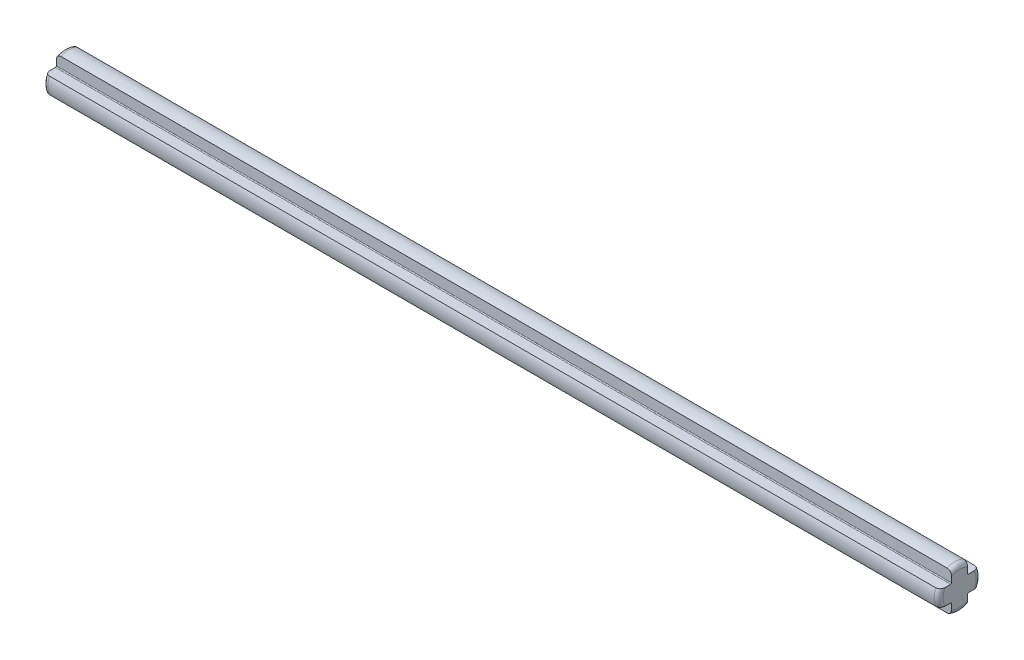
ISO-10303-21;
HEADER;
FILE_DESCRIPTION(('STEP AP214'),'2;1');
FILE_NAME('part.step','',(''),(''),'','','');
FILE_SCHEMA(('AUTOMOTIVE_DESIGN { 1 0 10303 214 1 1 1 1 }'));
ENDSEC;
DATA;
#1=APPLICATION_CONTEXT('core data for automotive mechanical design processes');
#2=APPLICATION_PROTOCOL_DEFINITION('international standard','automotive_design',2000,#1);
#3=PRODUCT_CONTEXT('',#1,'mechanical');
#4=PRODUCT('Part','Part','',(#3));
#5=PRODUCT_RELATED_PRODUCT_CATEGORY('part','',(#4));
#6=PRODUCT_DEFINITION_FORMATION('','',#4);
#7=PRODUCT_DEFINITION_CONTEXT('part definition',#1,'design');
#8=PRODUCT_DEFINITION('design','',#6,#7);
#9=PRODUCT_DEFINITION_SHAPE('','',#8);
#10=(LENGTH_UNIT() NAMED_UNIT(*) SI_UNIT(.MILLI.,.METRE.));
#11=(NAMED_UNIT(*) PLANE_ANGLE_UNIT() SI_UNIT($,.RADIAN.));
#12=(NAMED_UNIT(*) SI_UNIT($,.STERADIAN.) SOLID_ANGLE_UNIT());
#13=UNCERTAINTY_MEASURE_WITH_UNIT(LENGTH_MEASURE(1.E-05),#10,'distance_accuracy_value','');
#14=(GEOMETRIC_REPRESENTATION_CONTEXT(3) GLOBAL_UNCERTAINTY_ASSIGNED_CONTEXT((#13)) GLOBAL_UNIT_ASSIGNED_CONTEXT((#10,
#11,#12)) REPRESENTATION_CONTEXT('',''));
#15=CARTESIAN_POINT('',(0.,0.,0.));
#16=DIRECTION('',(0.,0.,1.));
#17=DIRECTION('',(1.,0.,0.));
#18=AXIS2_PLACEMENT_3D('',#15,#16,#17);
#19=CARTESIAN_POINT('',(50.,0.,0.));
#20=DIRECTION('',(-1.,0.,0.));
#21=DIRECTION('',(0.,0.,1.));
#22=AXIS2_PLACEMENT_3D('',#19,#20,#21);
#23=CYLINDRICAL_SURFACE('',#22,2.35);
#24=DIRECTION('',(-1.,0.,0.));
#25=VECTOR('',#24,1.);
#26=CARTESIAN_POINT('',(50.,0.9,2.17082933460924));
#27=LINE('',#26,#25);
#28=CARTESIAN_POINT('',(49.5,0.9,2.17082933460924));
#29=VERTEX_POINT('',#28);
#30=CARTESIAN_POINT('',(-49.5,0.9,2.17082933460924));
#31=VERTEX_POINT('',#30);
#32=EDGE_CURVE('E250',#29,#31,#27,.T.);
#33=ORIENTED_EDGE('',*,*,#32,.T.);
#34=CARTESIAN_POINT('',(-49.5,0.,0.));
#35=DIRECTION('',(1.,0.,0.));
#36=DIRECTION('',(0.,0.,-1.));
#37=AXIS2_PLACEMENT_3D('',#34,#35,#36);
#38=CIRCLE('',#37,2.35);
#39=CARTESIAN_POINT('',(-49.5,-0.900000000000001,2.17082933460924));
#40=VERTEX_POINT('',#39);
#41=EDGE_CURVE('E515',#31,#40,#38,.T.);
#42=ORIENTED_EDGE('',*,*,#41,.T.);
#43=DIRECTION('',(-1.,0.,0.));
#44=VECTOR('',#43,1.);
#45=CARTESIAN_POINT('',(50.,-0.900000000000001,2.17082933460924));
#46=LINE('',#45,#44);
#47=CARTESIAN_POINT('',(49.5,-0.900000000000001,2.17082933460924));
#48=VERTEX_POINT('',#47);
#49=EDGE_CURVE('E221',#48,#40,#46,.T.);
#50=ORIENTED_EDGE('',*,*,#49,.F.);
#51=CARTESIAN_POINT('',(49.5,0.,0.));
#52=DIRECTION('',(1.,0.,0.));
#53=DIRECTION('',(0.,0.,-1.));
#54=AXIS2_PLACEMENT_3D('',#51,#52,#53);
#55=CIRCLE('',#54,2.35);
#56=EDGE_CURVE('E370',#48,#29,#55,.F.);
#57=ORIENTED_EDGE('',*,*,#56,.T.);
#58=EDGE_LOOP('',(#33,#42,#50,#57));
#59=FACE_BOUND('',#58,.T.);
#60=ADVANCED_FACE('F37',(#59),#23,.T.);
#61=CARTESIAN_POINT('',(50.,-0.900000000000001,2.17082933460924));
#62=DIRECTION('',(0.,1.,0.));
#63=DIRECTION('',(0.,0.,1.));
#64=AXIS2_PLACEMENT_3D('',#61,#62,#63);
#65=PLANE('',#64);
#66=ORIENTED_EDGE('',*,*,#49,.T.);
#67=CARTESIAN_POINT('',(-49.5,-0.900000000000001,2.17082933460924));
#68=CARTESIAN_POINT('',(-49.5264833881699,-0.900000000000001,2.17085986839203));
#69=CARTESIAN_POINT('',(-49.5529498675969,-0.900000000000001,2.16855372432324));
#70=CARTESIAN_POINT('',(-49.6050453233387,-0.900000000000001,2.15950506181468));
#71=CARTESIAN_POINT('',(-49.6306762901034,-0.900000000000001,2.15277404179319));
#72=CARTESIAN_POINT('',(-49.6804387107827,-0.900000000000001,2.1351114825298));
#73=CARTESIAN_POINT('',(-49.7045703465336,-0.900000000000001,2.12418045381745));
#74=CARTESIAN_POINT('',(-49.7507251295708,-0.900000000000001,2.09852306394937));
#75=CARTESIAN_POINT('',(-49.7727475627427,-0.900000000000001,2.0837954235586));
#76=CARTESIAN_POINT('',(-49.8147234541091,-0.900000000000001,2.05060839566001));
#77=CARTESIAN_POINT('',(-49.8346070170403,-0.900000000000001,2.03206082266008));
#78=CARTESIAN_POINT('',(-49.8712243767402,-0.900000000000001,1.99209288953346));
#79=CARTESIAN_POINT('',(-49.8879579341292,-0.900000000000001,1.97067231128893));
#80=CARTESIAN_POINT('',(-49.9190973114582,-0.900000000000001,1.92396602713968));
#81=CARTESIAN_POINT('',(-49.9332527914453,-0.900000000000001,1.89851375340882));
#82=CARTESIAN_POINT('',(-49.9575247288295,-0.900000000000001,1.84573102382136));
#83=CARTESIAN_POINT('',(-49.9676367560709,-0.900000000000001,1.81839854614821));
#84=CARTESIAN_POINT('',(-49.9838866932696,-0.900000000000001,1.76219756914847));
#85=CARTESIAN_POINT('',(-49.9899702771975,-0.900000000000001,1.73331353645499));
#86=CARTESIAN_POINT('',(-49.9980270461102,-0.900000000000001,1.67505065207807));
#87=CARTESIAN_POINT('',(-50.0000109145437,-0.900000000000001,1.64567328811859));
#88=CARTESIAN_POINT('',(-50.,-0.900000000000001,1.61632298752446));
#89=B_SPLINE_CURVE_WITH_KNOTS('',3,(#67,#68,#69,#70,#71,#72,#73,#74,#75,#76,#77,#78,#79,#80,#81,
#82,#83,#84,#85,#86,#87,#88),.UNSPECIFIED.,.F.,.F.,(4,2,2,2,2,2,2,2,2,2,4),(0.,
0.0793238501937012,0.158442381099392,0.237551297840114,0.316686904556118,0.397909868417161,
0.479139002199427,0.56614777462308,0.653251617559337,0.74150740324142,0.829532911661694),.UNSPECIFIED.);
#90=CARTESIAN_POINT('',(-50.,-0.900000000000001,1.61632298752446));
#91=VERTEX_POINT('',#90);
#92=EDGE_CURVE('E390',#40,#91,#89,.T.);
#93=ORIENTED_EDGE('',*,*,#92,.T.);
#94=DIRECTION('',(0.,0.,-1.));
#95=VECTOR('',#94,1.);
#96=CARTESIAN_POINT('',(-50.,-0.900000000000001,2.17082933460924));
#97=LINE('',#96,#95);
#98=CARTESIAN_POINT('',(-50.,-0.900000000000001,0.999999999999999));
#99=VERTEX_POINT('',#98);
#100=EDGE_CURVE('E218',#91,#99,#97,.T.);
#101=ORIENTED_EDGE('',*,*,#100,.T.);
#102=DIRECTION('',(-1.,0.,0.));
#103=VECTOR('',#102,1.);
#104=CARTESIAN_POINT('',(50.,-0.900000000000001,0.999999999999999));
#105=LINE('',#104,#103);
#106=CARTESIAN_POINT('',(50.,-0.900000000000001,0.999999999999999));
#107=VERTEX_POINT('',#106);
#108=EDGE_CURVE('E214',#107,#99,#105,.T.);
#109=ORIENTED_EDGE('',*,*,#108,.F.);
#110=DIRECTION('',(0.,0.,-1.));
#111=VECTOR('',#110,1.);
#112=CARTESIAN_POINT('',(50.,-0.900000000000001,2.17082933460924));
#113=LINE('',#112,#111);
#114=CARTESIAN_POINT('',(50.,-0.900000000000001,1.61632298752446));
#115=VERTEX_POINT('',#114);
#116=EDGE_CURVE('E201',#115,#107,#113,.T.);
#117=ORIENTED_EDGE('',*,*,#116,.F.);
#118=CARTESIAN_POINT('',(50.,-0.900000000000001,1.61632298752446));
#119=CARTESIAN_POINT('',(50.0000222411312,-0.900000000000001,1.65066661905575));
#120=CARTESIAN_POINT('',(49.9972983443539,-0.900000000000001,1.68506058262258));
#121=CARTESIAN_POINT('',(49.9862156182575,-0.900000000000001,1.75308687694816));
#122=CARTESIAN_POINT('',(49.9778303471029,-0.900000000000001,1.78671486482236));
#123=CARTESIAN_POINT('',(49.9552419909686,-0.900000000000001,1.85211366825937));
#124=CARTESIAN_POINT('',(49.9410195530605,-0.900000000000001,1.88387790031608));
#125=CARTESIAN_POINT('',(49.9069131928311,-0.900000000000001,1.94414749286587));
#126=CARTESIAN_POINT('',(49.8870416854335,-0.900000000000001,1.97265980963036));
#127=CARTESIAN_POINT('',(49.844222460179,-0.900000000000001,2.02268935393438));
#128=CARTESIAN_POINT('',(49.8217526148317,-0.900000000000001,2.04461521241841));
#129=CARTESIAN_POINT('',(49.7730890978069,-0.900000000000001,2.08389547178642));
#130=CARTESIAN_POINT('',(49.7468952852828,-0.900000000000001,2.10124969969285));
#131=CARTESIAN_POINT('',(49.6943438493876,-0.900000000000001,2.12912089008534));
#132=CARTESIAN_POINT('',(49.6682509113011,-0.900000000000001,2.14013932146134));
#133=CARTESIAN_POINT('',(49.6145341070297,-0.900000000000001,2.15730052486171));
#134=CARTESIAN_POINT('',(49.586913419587,-0.900000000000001,2.1634530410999));
#135=CARTESIAN_POINT('',(49.5492135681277,-0.900000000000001,2.16830749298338));
#136=CARTESIAN_POINT('',(49.5393866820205,-0.900000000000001,2.1692533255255));
#137=CARTESIAN_POINT('',(49.5197081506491,-0.900000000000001,2.17051341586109));
#138=CARTESIAN_POINT('',(49.5098565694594,-0.900000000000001,2.17082867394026));
#139=CARTESIAN_POINT('',(49.5,-0.900000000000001,2.17082933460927));
#140=B_SPLINE_CURVE_WITH_KNOTS('',3,(#118,#119,#120,#121,#122,#123,#124,#125,#126,#127,#128,
#129,#130,#131,#132,#133,#134,#135,#136,#137,#138,#139),.UNSPECIFIED.,.F.,.F.,(4,2,2,2,2,2,2,2,
2,2,4),(0.,0.10300027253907,0.206484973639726,0.310315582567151,0.413919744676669,
0.507586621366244,0.60125704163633,0.685799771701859,0.770172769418,0.799774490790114,
0.829329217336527),.UNSPECIFIED.);
#141=EDGE_CURVE('E520',#115,#48,#140,.T.);
#142=ORIENTED_EDGE('',*,*,#141,.T.);
#143=EDGE_LOOP('',(#66,#93,#101,#109,#117,#142));
#144=FACE_BOUND('',#143,.T.);
#145=ADVANCED_FACE('F216',(#144),#65,.F.);
#146=CARTESIAN_POINT('',(50.,-1.,0.999999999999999));
#147=DIRECTION('',(-1.,0.,0.));
#148=DIRECTION('',(0.,0.,1.));
#149=AXIS2_PLACEMENT_3D('',#146,#147,#148);
#150=CYLINDRICAL_SURFACE('',#149,0.0999999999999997);
#151=CARTESIAN_POINT('',(-50.,-1.,0.999999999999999));
#152=DIRECTION('',(-1.,0.,0.));
#153=DIRECTION('',(0.,0.,1.));
#154=AXIS2_PLACEMENT_3D('',#151,#152,#153);
#155=CIRCLE('',#154,0.0999999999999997);
#156=CARTESIAN_POINT('',(-50.,-1.,0.899999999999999));
#157=VERTEX_POINT('',#156);
#158=EDGE_CURVE('E252',#99,#157,#155,.T.);
#159=ORIENTED_EDGE('',*,*,#158,.T.);
#160=DIRECTION('',(-1.,0.,0.));
#161=VECTOR('',#160,1.);
#162=CARTESIAN_POINT('',(50.,-1.,0.899999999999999));
#163=LINE('',#162,#161);
#164=CARTESIAN_POINT('',(50.,-1.,0.899999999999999));
#165=VERTEX_POINT('',#164);
#166=EDGE_CURVE('E222',#165,#157,#163,.T.);
#167=ORIENTED_EDGE('',*,*,#166,.F.);
#168=CARTESIAN_POINT('',(50.,-1.,0.999999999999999));
#169=DIRECTION('',(-1.,0.,0.));
#170=DIRECTION('',(0.,0.,1.));
#171=AXIS2_PLACEMENT_3D('',#168,#169,#170);
#172=CIRCLE('',#171,0.0999999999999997);
#173=EDGE_CURVE('E207',#107,#165,#172,.T.);
#174=ORIENTED_EDGE('',*,*,#173,.F.);
#175=ORIENTED_EDGE('',*,*,#108,.T.);
#176=EDGE_LOOP('',(#159,#167,#174,#175));
#177=FACE_BOUND('',#176,.T.);
#178=ADVANCED_FACE('F224',(#177),#150,.F.);
#179=CARTESIAN_POINT('',(50.,-2.17082933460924,0.899999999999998));
#180=DIRECTION('',(0.,0.,-1.));
#181=DIRECTION('',(0.,1.,0.));
#182=AXIS2_PLACEMENT_3D('',#179,#180,#181);
#183=PLANE('',#182);
#184=DIRECTION('',(0.,-1.,0.));
#185=VECTOR('',#184,1.);
#186=CARTESIAN_POINT('',(-50.,-2.17082933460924,0.899999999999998));
#187=LINE('',#186,#185);
#188=CARTESIAN_POINT('',(-50.,-1.61632298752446,0.899999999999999));
#189=VERTEX_POINT('',#188);
#190=EDGE_CURVE('E254',#157,#189,#187,.T.);
#191=ORIENTED_EDGE('',*,*,#190,.T.);
#192=CARTESIAN_POINT('',(-50.,-1.61632298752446,0.899999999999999));
#193=CARTESIAN_POINT('',(-50.0000222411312,-1.65066661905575,0.899999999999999));
#194=CARTESIAN_POINT('',(-49.9972983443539,-1.68506058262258,0.899999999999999));
#195=CARTESIAN_POINT('',(-49.9862156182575,-1.75308687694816,0.899999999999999));
#196=CARTESIAN_POINT('',(-49.9778303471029,-1.78671486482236,0.899999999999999));
#197=CARTESIAN_POINT('',(-49.9552419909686,-1.85211366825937,0.899999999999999));
#198=CARTESIAN_POINT('',(-49.9410195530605,-1.88387790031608,0.899999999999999));
#199=CARTESIAN_POINT('',(-49.9069131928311,-1.94414749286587,0.899999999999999));
#200=CARTESIAN_POINT('',(-49.8870416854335,-1.97265980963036,0.899999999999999));
#201=CARTESIAN_POINT('',(-49.844222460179,-2.02268935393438,0.899999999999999));
#202=CARTESIAN_POINT('',(-49.8217526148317,-2.04461521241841,0.899999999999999));
#203=CARTESIAN_POINT('',(-49.7730890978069,-2.08389547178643,0.899999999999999));
#204=CARTESIAN_POINT('',(-49.7468952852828,-2.10124969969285,0.899999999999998));
#205=CARTESIAN_POINT('',(-49.6943438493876,-2.12912089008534,0.899999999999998));
#206=CARTESIAN_POINT('',(-49.6682509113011,-2.14013932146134,0.899999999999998));
#207=CARTESIAN_POINT('',(-49.6145341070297,-2.15730052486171,0.899999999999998));
#208=CARTESIAN_POINT('',(-49.586913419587,-2.1634530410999,0.899999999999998));
#209=CARTESIAN_POINT('',(-49.5492135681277,-2.16830749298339,0.899999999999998));
#210=CARTESIAN_POINT('',(-49.5393866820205,-2.1692533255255,0.899999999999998));
#211=CARTESIAN_POINT('',(-49.5197081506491,-2.17051341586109,0.899999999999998));
#212=CARTESIAN_POINT('',(-49.5098565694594,-2.17082867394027,0.899999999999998));
#213=CARTESIAN_POINT('',(-49.5,-2.17082933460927,0.899999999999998));
#214=B_SPLINE_CURVE_WITH_KNOTS('',3,(#192,#193,#194,#195,#196,#197,#198,#199,#200,#201,#202,
#203,#204,#205,#206,#207,#208,#209,#210,#211,#212,#213),.UNSPECIFIED.,.F.,.F.,(4,2,2,2,2,2,2,2,
2,2,4),(0.,0.103000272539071,0.206484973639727,0.310315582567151,0.413919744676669,
0.507586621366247,0.601257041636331,0.68579977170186,0.770172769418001,0.799774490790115,
0.829329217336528),.UNSPECIFIED.);
#215=CARTESIAN_POINT('',(-49.5,-2.17082933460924,0.899999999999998));
#216=VERTEX_POINT('',#215);
#217=EDGE_CURVE('E365',#189,#216,#214,.T.);
#218=ORIENTED_EDGE('',*,*,#217,.T.);
#219=DIRECTION('',(-1.,0.,0.));
#220=VECTOR('',#219,1.);
#221=CARTESIAN_POINT('',(50.,-2.17082933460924,0.899999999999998));
#222=LINE('',#221,#220);
#223=CARTESIAN_POINT('',(49.5,-2.17082933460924,0.899999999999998));
#224=VERTEX_POINT('',#223);
#225=EDGE_CURVE('E312',#224,#216,#222,.T.);
#226=ORIENTED_EDGE('',*,*,#225,.F.);
#227=CARTESIAN_POINT('',(49.5,-2.17082933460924,0.899999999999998));
#228=CARTESIAN_POINT('',(49.5264833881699,-2.17085986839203,0.899999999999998));
#229=CARTESIAN_POINT('',(49.5529498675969,-2.16855372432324,0.899999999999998));
#230=CARTESIAN_POINT('',(49.6050453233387,-2.15950506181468,0.899999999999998));
#231=CARTESIAN_POINT('',(49.6306762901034,-2.15277404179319,0.899999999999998));
#232=CARTESIAN_POINT('',(49.6804387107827,-2.1351114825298,0.899999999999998));
#233=CARTESIAN_POINT('',(49.7045703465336,-2.12418045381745,0.899999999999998));
#234=CARTESIAN_POINT('',(49.7507251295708,-2.09852306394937,0.899999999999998));
#235=CARTESIAN_POINT('',(49.7727475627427,-2.0837954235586,0.899999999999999));
#236=CARTESIAN_POINT('',(49.8147234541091,-2.05060839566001,0.899999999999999));
#237=CARTESIAN_POINT('',(49.8346070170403,-2.03206082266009,0.899999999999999));
#238=CARTESIAN_POINT('',(49.8712243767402,-1.99209288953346,0.899999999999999));
#239=CARTESIAN_POINT('',(49.8879579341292,-1.97067231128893,0.899999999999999));
#240=CARTESIAN_POINT('',(49.9190973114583,-1.92396602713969,0.899999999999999));
#241=CARTESIAN_POINT('',(49.9332527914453,-1.89851375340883,0.899999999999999));
#242=CARTESIAN_POINT('',(49.9575247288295,-1.84573102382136,0.899999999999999));
#243=CARTESIAN_POINT('',(49.9676367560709,-1.81839854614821,0.899999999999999));
#244=CARTESIAN_POINT('',(49.9838866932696,-1.76219756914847,0.899999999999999));
#245=CARTESIAN_POINT('',(49.9899702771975,-1.733313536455,0.899999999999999));
#246=CARTESIAN_POINT('',(49.9980270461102,-1.67505065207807,0.899999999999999));
#247=CARTESIAN_POINT('',(50.0000109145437,-1.64567328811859,0.899999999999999));
#248=CARTESIAN_POINT('',(50.,-1.61632298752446,0.899999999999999));
#249=B_SPLINE_CURVE_WITH_KNOTS('',3,(#227,#228,#229,#230,#231,#232,#233,#234,#235,#236,#237,
#238,#239,#240,#241,#242,#243,#244,#245,#246,#247,#248),.UNSPECIFIED.,.F.,.F.,(4,2,2,2,2,2,2,2,
2,2,4),(0.,0.0793238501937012,0.158442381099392,0.237551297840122,0.316686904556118,
0.397909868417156,0.479139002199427,0.566147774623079,0.653251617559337,0.741507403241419,
0.829532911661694),.UNSPECIFIED.);
#250=CARTESIAN_POINT('',(50.,-1.61632298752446,0.899999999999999));
#251=VERTEX_POINT('',#250);
#252=EDGE_CURVE('E359',#224,#251,#249,.T.);
#253=ORIENTED_EDGE('',*,*,#252,.T.);
#254=DIRECTION('',(0.,-1.,0.));
#255=VECTOR('',#254,1.);
#256=CARTESIAN_POINT('',(50.,-2.17082933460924,0.899999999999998));
#257=LINE('',#256,#255);
#258=EDGE_CURVE('E227',#165,#251,#257,.T.);
#259=ORIENTED_EDGE('',*,*,#258,.F.);
#260=ORIENTED_EDGE('',*,*,#166,.T.);
#261=EDGE_LOOP('',(#191,#218,#226,#253,#259,#260));
#262=FACE_BOUND('',#261,.T.);
#263=ADVANCED_FACE('F350',(#262),#183,.F.);
#264=CARTESIAN_POINT('',(50.,0.,0.));
#265=DIRECTION('',(-1.,0.,0.));
#266=DIRECTION('',(0.,0.,1.));
#267=AXIS2_PLACEMENT_3D('',#264,#265,#266);
#268=CYLINDRICAL_SURFACE('',#267,2.35);
#269=ORIENTED_EDGE('',*,*,#225,.T.);
#270=CARTESIAN_POINT('',(-49.5,0.,0.));
#271=DIRECTION('',(1.,0.,0.));
#272=DIRECTION('',(0.,0.,-1.));
#273=AXIS2_PLACEMENT_3D('',#270,#271,#272);
#274=CIRCLE('',#273,2.35);
#275=CARTESIAN_POINT('',(-49.5,-2.17082933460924,-0.9));
#276=VERTEX_POINT('',#275);
#277=EDGE_CURVE('E319',#216,#276,#274,.T.);
#278=ORIENTED_EDGE('',*,*,#277,.T.);
#279=DIRECTION('',(-1.,0.,0.));
#280=VECTOR('',#279,1.);
#281=CARTESIAN_POINT('',(50.,-2.17082933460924,-0.9));
#282=LINE('',#281,#280);
#283=CARTESIAN_POINT('',(49.5,-2.17082933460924,-0.9));
#284=VERTEX_POINT('',#283);
#285=EDGE_CURVE('E309',#284,#276,#282,.T.);
#286=ORIENTED_EDGE('',*,*,#285,.F.);
#287=CARTESIAN_POINT('',(49.5,0.,0.));
#288=DIRECTION('',(1.,0.,0.));
#289=DIRECTION('',(0.,0.,-1.));
#290=AXIS2_PLACEMENT_3D('',#287,#288,#289);
#291=CIRCLE('',#290,2.35);
#292=EDGE_CURVE('E317',#284,#224,#291,.F.);
#293=ORIENTED_EDGE('',*,*,#292,.T.);
#294=EDGE_LOOP('',(#269,#278,#286,#293));
#295=FACE_BOUND('',#294,.T.);
#296=ADVANCED_FACE('F344',(#295),#268,.T.);
#297=CARTESIAN_POINT('',(50.,-2.17082933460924,-0.9));
#298=DIRECTION('',(0.,0.,1.));
#299=DIRECTION('',(0.,-1.,0.));
#300=AXIS2_PLACEMENT_3D('',#297,#298,#299);
#301=PLANE('',#300);
#302=ORIENTED_EDGE('',*,*,#285,.T.);
#303=CARTESIAN_POINT('',(-49.5,-2.17082933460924,-0.9));
#304=CARTESIAN_POINT('',(-49.5264833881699,-2.17085986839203,-0.9));
#305=CARTESIAN_POINT('',(-49.5529498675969,-2.16855372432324,-0.9));
#306=CARTESIAN_POINT('',(-49.6050453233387,-2.15950506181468,-0.9));
#307=CARTESIAN_POINT('',(-49.6306762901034,-2.15277404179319,-0.9));
#308=CARTESIAN_POINT('',(-49.6804387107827,-2.1351114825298,-0.9));
#309=CARTESIAN_POINT('',(-49.7045703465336,-2.12418045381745,-0.9));
#310=CARTESIAN_POINT('',(-49.7507251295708,-2.09852306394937,-0.9));
#311=CARTESIAN_POINT('',(-49.7727475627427,-2.0837954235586,-0.9));
#312=CARTESIAN_POINT('',(-49.8147234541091,-2.05060839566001,-0.9));
#313=CARTESIAN_POINT('',(-49.8346070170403,-2.03206082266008,-0.9));
#314=CARTESIAN_POINT('',(-49.8712243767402,-1.99209288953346,-0.9));
#315=CARTESIAN_POINT('',(-49.8879579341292,-1.97067231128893,-0.9));
#316=CARTESIAN_POINT('',(-49.9190973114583,-1.92396602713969,-0.9));
#317=CARTESIAN_POINT('',(-49.9332527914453,-1.89851375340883,-0.9));
#318=CARTESIAN_POINT('',(-49.9575247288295,-1.84573102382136,-0.9));
#319=CARTESIAN_POINT('',(-49.9676367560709,-1.81839854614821,-0.9));
#320=CARTESIAN_POINT('',(-49.9838866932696,-1.76219756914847,-0.9));
#321=CARTESIAN_POINT('',(-49.9899702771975,-1.73331353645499,-0.9));
#322=CARTESIAN_POINT('',(-49.9980270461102,-1.67505065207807,-0.9));
#323=CARTESIAN_POINT('',(-50.0000109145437,-1.64567328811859,-0.9));
#324=CARTESIAN_POINT('',(-50.,-1.61632298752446,-0.9));
#325=B_SPLINE_CURVE_WITH_KNOTS('',3,(#303,#304,#305,#306,#307,#308,#309,#310,#311,#312,#313,
#314,#315,#316,#317,#318,#319,#320,#321,#322,#323,#324),.UNSPECIFIED.,.F.,.F.,(4,2,2,2,2,2,2,2,
2,2,4),(0.,0.0793238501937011,0.158442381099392,0.237551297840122,0.316686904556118,
0.397909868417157,0.479139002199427,0.566147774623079,0.653251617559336,0.74150740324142,
0.829532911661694),.UNSPECIFIED.);
#326=CARTESIAN_POINT('',(-50.,-1.61632298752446,-0.9));
#327=VERTEX_POINT('',#326);
#328=EDGE_CURVE('E329',#276,#327,#325,.T.);
#329=ORIENTED_EDGE('',*,*,#328,.T.);
#330=DIRECTION('',(0.,1.,0.));
#331=VECTOR('',#330,1.);
#332=CARTESIAN_POINT('',(-50.,-2.17082933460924,-0.9));
#333=LINE('',#332,#331);
#334=CARTESIAN_POINT('',(-50.,-1.,-0.9));
#335=VERTEX_POINT('',#334);
#336=EDGE_CURVE('E257',#327,#335,#333,.T.);
#337=ORIENTED_EDGE('',*,*,#336,.T.);
#338=DIRECTION('',(-1.,0.,0.));
#339=VECTOR('',#338,1.);
#340=CARTESIAN_POINT('',(50.,-1.,-0.9));
#341=LINE('',#340,#339);
#342=CARTESIAN_POINT('',(50.,-1.,-0.9));
#343=VERTEX_POINT('',#342);
#344=EDGE_CURVE('E306',#343,#335,#341,.T.);
#345=ORIENTED_EDGE('',*,*,#344,.F.);
#346=DIRECTION('',(0.,1.,0.));
#347=VECTOR('',#346,1.);
#348=CARTESIAN_POINT('',(50.,-2.17082933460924,-0.9));
#349=LINE('',#348,#347);
#350=CARTESIAN_POINT('',(50.,-1.61632298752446,-0.9));
#351=VERTEX_POINT('',#350);
#352=EDGE_CURVE('E229',#351,#343,#349,.T.);
#353=ORIENTED_EDGE('',*,*,#352,.F.);
#354=CARTESIAN_POINT('',(50.,-1.61632298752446,-0.9));
#355=CARTESIAN_POINT('',(50.0000222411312,-1.65066661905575,-0.9));
#356=CARTESIAN_POINT('',(49.9972983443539,-1.68506058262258,-0.9));
#357=CARTESIAN_POINT('',(49.9862156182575,-1.75308687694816,-0.9));
#358=CARTESIAN_POINT('',(49.9778303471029,-1.78671486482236,-0.9));
#359=CARTESIAN_POINT('',(49.9552419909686,-1.85211366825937,-0.9));
#360=CARTESIAN_POINT('',(49.9410195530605,-1.88387790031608,-0.9));
#361=CARTESIAN_POINT('',(49.9069131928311,-1.94414749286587,-0.9));
#362=CARTESIAN_POINT('',(49.8870416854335,-1.97265980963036,-0.9));
#363=CARTESIAN_POINT('',(49.844222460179,-2.02268935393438,-0.9));
#364=CARTESIAN_POINT('',(49.8217526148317,-2.04461521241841,-0.9));
#365=CARTESIAN_POINT('',(49.7730890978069,-2.08389547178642,-0.9));
#366=CARTESIAN_POINT('',(49.7468952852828,-2.10124969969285,-0.9));
#367=CARTESIAN_POINT('',(49.6943438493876,-2.12912089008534,-0.9));
#368=CARTESIAN_POINT('',(49.6682509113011,-2.14013932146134,-0.9));
#369=CARTESIAN_POINT('',(49.6145341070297,-2.15730052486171,-0.9));
#370=CARTESIAN_POINT('',(49.586913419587,-2.1634530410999,-0.9));
#371=CARTESIAN_POINT('',(49.5492135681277,-2.16830749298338,-0.9));
#372=CARTESIAN_POINT('',(49.5393866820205,-2.1692533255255,-0.9));
#373=CARTESIAN_POINT('',(49.5197081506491,-2.17051341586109,-0.9));
#374=CARTESIAN_POINT('',(49.5098565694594,-2.17082867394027,-0.9));
#375=CARTESIAN_POINT('',(49.5,-2.17082933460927,-0.9));
#376=B_SPLINE_CURVE_WITH_KNOTS('',3,(#354,#355,#356,#357,#358,#359,#360,#361,#362,#363,#364,
#365,#366,#367,#368,#369,#370,#371,#372,#373,#374,#375),.UNSPECIFIED.,.F.,.F.,(4,2,2,2,2,2,2,2,
2,2,4),(0.,0.10300027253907,0.206484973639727,0.310315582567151,0.413919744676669,
0.507586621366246,0.601257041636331,0.68579977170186,0.770172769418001,0.799774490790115,
0.829329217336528),.UNSPECIFIED.);
#377=EDGE_CURVE('E322',#351,#284,#376,.T.);
#378=ORIENTED_EDGE('',*,*,#377,.T.);
#379=EDGE_LOOP('',(#302,#329,#337,#345,#353,#378));
#380=FACE_BOUND('',#379,.T.);
#381=ADVANCED_FACE('F338',(#380),#301,.F.);
#382=CARTESIAN_POINT('',(50.,-1.,-1.));
#383=DIRECTION('',(-1.,0.,0.));
#384=DIRECTION('',(0.,0.,1.));
#385=AXIS2_PLACEMENT_3D('',#382,#383,#384);
#386=CYLINDRICAL_SURFACE('',#385,0.0999999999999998);
#387=CARTESIAN_POINT('',(-50.,-1.,-1.));
#388=DIRECTION('',(-1.,0.,0.));
#389=DIRECTION('',(0.,0.,-1.));
#390=AXIS2_PLACEMENT_3D('',#387,#388,#389);
#391=CIRCLE('',#390,0.0999999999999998);
#392=CARTESIAN_POINT('',(-50.,-0.9,-1.));
#393=VERTEX_POINT('',#392);
#394=EDGE_CURVE('E259',#335,#393,#391,.T.);
#395=ORIENTED_EDGE('',*,*,#394,.T.);
#396=DIRECTION('',(-1.,0.,0.));
#397=VECTOR('',#396,1.);
#398=CARTESIAN_POINT('',(50.,-0.9,-1.));
#399=LINE('',#398,#397);
#400=CARTESIAN_POINT('',(50.,-0.9,-1.));
#401=VERTEX_POINT('',#400);
#402=EDGE_CURVE('E303',#401,#393,#399,.T.);
#403=ORIENTED_EDGE('',*,*,#402,.F.);
#404=CARTESIAN_POINT('',(50.,-1.,-1.));
#405=DIRECTION('',(-1.,0.,0.));
#406=DIRECTION('',(0.,0.,-1.));
#407=AXIS2_PLACEMENT_3D('',#404,#405,#406);
#408=CIRCLE('',#407,0.0999999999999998);
#409=EDGE_CURVE('E233',#343,#401,#408,.T.);
#410=ORIENTED_EDGE('',*,*,#409,.F.);
#411=ORIENTED_EDGE('',*,*,#344,.T.);
#412=EDGE_LOOP('',(#395,#403,#410,#411));
#413=FACE_BOUND('',#412,.T.);
#414=ADVANCED_FACE('F343',(#413),#386,.F.);
#415=CARTESIAN_POINT('',(50.,-0.900000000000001,-2.17082933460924));
#416=DIRECTION('',(0.,1.,0.));
#417=DIRECTION('',(0.,0.,1.));
#418=AXIS2_PLACEMENT_3D('',#415,#416,#417);
#419=PLANE('',#418);
#420=DIRECTION('',(0.,0.,-1.));
#421=VECTOR('',#420,1.);
#422=CARTESIAN_POINT('',(-50.,-0.900000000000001,-2.17082933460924));
#423=LINE('',#422,#421);
#424=CARTESIAN_POINT('',(-50.,-0.9,-1.61632298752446));
#425=VERTEX_POINT('',#424);
#426=EDGE_CURVE('E261',#393,#425,#423,.T.);
#427=ORIENTED_EDGE('',*,*,#426,.T.);
#428=CARTESIAN_POINT('',(-50.,-0.9,-1.61632298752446));
#429=CARTESIAN_POINT('',(-50.0000222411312,-0.9,-1.65066661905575));
#430=CARTESIAN_POINT('',(-49.9972983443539,-0.9,-1.68506058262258));
#431=CARTESIAN_POINT('',(-49.9862156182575,-0.9,-1.75308687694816));
#432=CARTESIAN_POINT('',(-49.9778303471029,-0.9,-1.78671486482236));
#433=CARTESIAN_POINT('',(-49.9552419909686,-0.9,-1.85211366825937));
#434=CARTESIAN_POINT('',(-49.9410195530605,-0.9,-1.88387790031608));
#435=CARTESIAN_POINT('',(-49.9069131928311,-0.9,-1.94414749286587));
#436=CARTESIAN_POINT('',(-49.8870416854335,-0.9,-1.97265980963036));
#437=CARTESIAN_POINT('',(-49.844222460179,-0.9,-2.02268935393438));
#438=CARTESIAN_POINT('',(-49.8217526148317,-0.900000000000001,-2.04461521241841));
#439=CARTESIAN_POINT('',(-49.7730890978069,-0.900000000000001,-2.08389547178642));
#440=CARTESIAN_POINT('',(-49.7468952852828,-0.900000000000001,-2.10124969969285));
#441=CARTESIAN_POINT('',(-49.6943438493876,-0.900000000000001,-2.12912089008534));
#442=CARTESIAN_POINT('',(-49.6682509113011,-0.900000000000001,-2.14013932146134));
#443=CARTESIAN_POINT('',(-49.6145341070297,-0.900000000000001,-2.15730052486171));
#444=CARTESIAN_POINT('',(-49.586913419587,-0.900000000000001,-2.1634530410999));
#445=CARTESIAN_POINT('',(-49.5492135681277,-0.900000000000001,-2.16830749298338));
#446=CARTESIAN_POINT('',(-49.5393866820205,-0.900000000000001,-2.1692533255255));
#447=CARTESIAN_POINT('',(-49.5197081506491,-0.900000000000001,-2.17051341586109));
#448=CARTESIAN_POINT('',(-49.5098565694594,-0.900000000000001,-2.17082867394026));
#449=CARTESIAN_POINT('',(-49.5,-0.900000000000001,-2.17082933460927));
#450=B_SPLINE_CURVE_WITH_KNOTS('',3,(#428,#429,#430,#431,#432,#433,#434,#435,#436,#437,#438,
#439,#440,#441,#442,#443,#444,#445,#446,#447,#448,#449),.UNSPECIFIED.,.F.,.F.,(4,2,2,2,2,2,2,2,
2,2,4),(0.,0.103000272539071,0.206484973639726,0.310315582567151,0.413919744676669,
0.507586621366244,0.60125704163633,0.68579977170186,0.770172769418,0.799774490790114,
0.829329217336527),.UNSPECIFIED.);
#451=CARTESIAN_POINT('',(-49.5,-0.9,-2.17082933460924));
#452=VERTEX_POINT('',#451);
#453=EDGE_CURVE('E489',#425,#452,#450,.T.);
#454=ORIENTED_EDGE('',*,*,#453,.T.);
#455=DIRECTION('',(-1.,0.,0.));
#456=VECTOR('',#455,1.);
#457=CARTESIAN_POINT('',(50.,-0.9,-2.17082933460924));
#458=LINE('',#457,#456);
#459=CARTESIAN_POINT('',(49.5,-0.9,-2.17082933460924));
#460=VERTEX_POINT('',#459);
#461=EDGE_CURVE('E300',#460,#452,#458,.T.);
#462=ORIENTED_EDGE('',*,*,#461,.F.);
#463=CARTESIAN_POINT('',(49.5,-0.9,-2.17082933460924));
#464=CARTESIAN_POINT('',(49.5264833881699,-0.9,-2.17085986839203));
#465=CARTESIAN_POINT('',(49.5529498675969,-0.900000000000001,-2.16855372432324));
#466=CARTESIAN_POINT('',(49.6050453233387,-0.900000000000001,-2.15950506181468));
#467=CARTESIAN_POINT('',(49.6306762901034,-0.900000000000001,-2.15277404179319));
#468=CARTESIAN_POINT('',(49.6804387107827,-0.900000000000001,-2.1351114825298));
#469=CARTESIAN_POINT('',(49.7045703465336,-0.900000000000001,-2.12418045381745));
#470=CARTESIAN_POINT('',(49.7507251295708,-0.900000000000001,-2.09852306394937));
#471=CARTESIAN_POINT('',(49.7727475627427,-0.900000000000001,-2.0837954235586));
#472=CARTESIAN_POINT('',(49.8147234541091,-0.900000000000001,-2.05060839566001));
#473=CARTESIAN_POINT('',(49.8346070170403,-0.9,-2.03206082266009));
#474=CARTESIAN_POINT('',(49.8712243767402,-0.9,-1.99209288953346));
#475=CARTESIAN_POINT('',(49.8879579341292,-0.9,-1.97067231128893));
#476=CARTESIAN_POINT('',(49.9190973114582,-0.9,-1.92396602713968));
#477=CARTESIAN_POINT('',(49.9332527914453,-0.9,-1.89851375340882));
#478=CARTESIAN_POINT('',(49.9575247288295,-0.9,-1.84573102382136));
#479=CARTESIAN_POINT('',(49.9676367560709,-0.9,-1.81839854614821));
#480=CARTESIAN_POINT('',(49.9838866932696,-0.9,-1.76219756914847));
#481=CARTESIAN_POINT('',(49.9899702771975,-0.9,-1.73331353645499));
#482=CARTESIAN_POINT('',(49.9980270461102,-0.9,-1.67505065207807));
#483=CARTESIAN_POINT('',(50.0000109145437,-0.9,-1.64567328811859));
#484=CARTESIAN_POINT('',(50.,-0.9,-1.61632298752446));
#485=B_SPLINE_CURVE_WITH_KNOTS('',3,(#463,#464,#465,#466,#467,#468,#469,#470,#471,#472,#473,
#474,#475,#476,#477,#478,#479,#480,#481,#482,#483,#484),.UNSPECIFIED.,.F.,.F.,(4,2,2,2,2,2,2,2,
2,2,4),(0.,0.0793238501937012,0.158442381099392,0.237551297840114,0.316686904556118,
0.397909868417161,0.479139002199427,0.56614777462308,0.653251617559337,0.74150740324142,
0.829532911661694),.UNSPECIFIED.);
#486=CARTESIAN_POINT('',(50.,-0.9,-1.61632298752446));
#487=VERTEX_POINT('',#486);
#488=EDGE_CURVE('E53',#460,#487,#485,.T.);
#489=ORIENTED_EDGE('',*,*,#488,.T.);
#490=DIRECTION('',(0.,0.,-1.));
#491=VECTOR('',#490,1.);
#492=CARTESIAN_POINT('',(50.,-0.900000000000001,-2.17082933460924));
#493=LINE('',#492,#491);
#494=EDGE_CURVE('E235',#401,#487,#493,.T.);
#495=ORIENTED_EDGE('',*,*,#494,.F.);
#496=ORIENTED_EDGE('',*,*,#402,.T.);
#497=EDGE_LOOP('',(#427,#454,#462,#489,#495,#496));
#498=FACE_BOUND('',#497,.T.);
#499=ADVANCED_FACE('F496',(#498),#419,.F.);
#500=CARTESIAN_POINT('',(50.,0.,0.));
#501=DIRECTION('',(-1.,0.,0.));
#502=DIRECTION('',(0.,0.,1.));
#503=AXIS2_PLACEMENT_3D('',#500,#501,#502);
#504=CYLINDRICAL_SURFACE('',#503,2.35);
#505=ORIENTED_EDGE('',*,*,#461,.T.);
#506=CARTESIAN_POINT('',(-49.5,0.,0.));
#507=DIRECTION('',(1.,0.,0.));
#508=DIRECTION('',(0.,0.,-1.));
#509=AXIS2_PLACEMENT_3D('',#506,#507,#508);
#510=CIRCLE('',#509,2.35);
#511=CARTESIAN_POINT('',(-49.5,0.900000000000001,-2.17082933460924));
#512=VERTEX_POINT('',#511);
#513=EDGE_CURVE('E575',#452,#512,#510,.T.);
#514=ORIENTED_EDGE('',*,*,#513,.T.);
#515=DIRECTION('',(-1.,0.,0.));
#516=VECTOR('',#515,1.);
#517=CARTESIAN_POINT('',(50.,0.900000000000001,-2.17082933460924));
#518=LINE('',#517,#516);
#519=CARTESIAN_POINT('',(49.5,0.900000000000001,-2.17082933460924));
#520=VERTEX_POINT('',#519);
#521=EDGE_CURVE('E297',#520,#512,#518,.T.);
#522=ORIENTED_EDGE('',*,*,#521,.F.);
#523=CARTESIAN_POINT('',(49.5,0.,0.));
#524=DIRECTION('',(1.,0.,0.));
#525=DIRECTION('',(0.,0.,-1.));
#526=AXIS2_PLACEMENT_3D('',#523,#524,#525);
#527=CIRCLE('',#526,2.35);
#528=EDGE_CURVE('E574',#520,#460,#527,.F.);
#529=ORIENTED_EDGE('',*,*,#528,.T.);
#530=EDGE_LOOP('',(#505,#514,#522,#529));
#531=FACE_BOUND('',#530,.T.);
#532=ADVANCED_FACE('F464',(#531),#504,.T.);
#533=CARTESIAN_POINT('',(50.,0.900000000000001,-2.17082933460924));
#534=DIRECTION('',(0.,-1.,0.));
#535=DIRECTION('',(0.,0.,-1.));
#536=AXIS2_PLACEMENT_3D('',#533,#534,#535);
#537=PLANE('',#536);
#538=ORIENTED_EDGE('',*,*,#521,.T.);
#539=CARTESIAN_POINT('',(-49.5,0.900000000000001,-2.17082933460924));
#540=CARTESIAN_POINT('',(-49.5264833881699,0.900000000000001,-2.17085986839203));
#541=CARTESIAN_POINT('',(-49.5529498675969,0.900000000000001,-2.16855372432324));
#542=CARTESIAN_POINT('',(-49.6050453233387,0.900000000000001,-2.15950506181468));
#543=CARTESIAN_POINT('',(-49.6306762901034,0.900000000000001,-2.15277404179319));
#544=CARTESIAN_POINT('',(-49.6804387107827,0.900000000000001,-2.1351114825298));
#545=CARTESIAN_POINT('',(-49.7045703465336,0.900000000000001,-2.12418045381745));
#546=CARTESIAN_POINT('',(-49.7507251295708,0.900000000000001,-2.09852306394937));
#547=CARTESIAN_POINT('',(-49.7727475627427,0.900000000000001,-2.0837954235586));
#548=CARTESIAN_POINT('',(-49.8147234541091,0.900000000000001,-2.05060839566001));
#549=CARTESIAN_POINT('',(-49.8346070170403,0.9,-2.03206082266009));
#550=CARTESIAN_POINT('',(-49.8712243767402,0.9,-1.99209288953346));
#551=CARTESIAN_POINT('',(-49.8879579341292,0.9,-1.97067231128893));
#552=CARTESIAN_POINT('',(-49.9190973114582,0.9,-1.92396602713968));
#553=CARTESIAN_POINT('',(-49.9332527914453,0.9,-1.89851375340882));
#554=CARTESIAN_POINT('',(-49.9575247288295,0.9,-1.84573102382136));
#555=CARTESIAN_POINT('',(-49.9676367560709,0.9,-1.81839854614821));
#556=CARTESIAN_POINT('',(-49.9838866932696,0.9,-1.76219756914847));
#557=CARTESIAN_POINT('',(-49.9899702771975,0.9,-1.73331353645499));
#558=CARTESIAN_POINT('',(-49.9980270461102,0.9,-1.67505065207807));
#559=CARTESIAN_POINT('',(-50.0000109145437,0.9,-1.64567328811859));
#560=CARTESIAN_POINT('',(-50.,0.9,-1.61632298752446));
#561=B_SPLINE_CURVE_WITH_KNOTS('',3,(#539,#540,#541,#542,#543,#544,#545,#546,#547,#548,#549,
#550,#551,#552,#553,#554,#555,#556,#557,#558,#559,#560),.UNSPECIFIED.,.F.,.F.,(4,2,2,2,2,2,2,2,
2,2,4),(0.,0.0793238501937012,0.158442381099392,0.237551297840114,0.316686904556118,
0.397909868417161,0.479139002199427,0.56614777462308,0.653251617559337,0.74150740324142,
0.829532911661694),.UNSPECIFIED.);
#562=CARTESIAN_POINT('',(-50.,0.9,-1.61632298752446));
#563=VERTEX_POINT('',#562);
#564=EDGE_CURVE('E473',#512,#563,#561,.T.);
#565=ORIENTED_EDGE('',*,*,#564,.T.);
#566=DIRECTION('',(0.,0.,1.));
#567=VECTOR('',#566,1.);
#568=CARTESIAN_POINT('',(-50.,0.900000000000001,-2.17082933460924));
#569=LINE('',#568,#567);
#570=CARTESIAN_POINT('',(-50.,0.9,-1.));
#571=VERTEX_POINT('',#570);
#572=EDGE_CURVE('E264',#563,#571,#569,.T.);
#573=ORIENTED_EDGE('',*,*,#572,.T.);
#574=DIRECTION('',(-1.,0.,0.));
#575=VECTOR('',#574,1.);
#576=CARTESIAN_POINT('',(50.,0.9,-1.));
#577=LINE('',#576,#575);
#578=CARTESIAN_POINT('',(50.,0.9,-1.));
#579=VERTEX_POINT('',#578);
#580=EDGE_CURVE('E294',#579,#571,#577,.T.);
#581=ORIENTED_EDGE('',*,*,#580,.F.);
#582=DIRECTION('',(0.,0.,1.));
#583=VECTOR('',#582,1.);
#584=CARTESIAN_POINT('',(50.,0.900000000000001,-2.17082933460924));
#585=LINE('',#584,#583);
#586=CARTESIAN_POINT('',(50.,0.9,-1.61632298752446));
#587=VERTEX_POINT('',#586);
#588=EDGE_CURVE('E237',#587,#579,#585,.T.);
#589=ORIENTED_EDGE('',*,*,#588,.F.);
#590=CARTESIAN_POINT('',(50.,0.9,-1.61632298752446));
#591=CARTESIAN_POINT('',(50.0000222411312,0.9,-1.65066661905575));
#592=CARTESIAN_POINT('',(49.9972983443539,0.9,-1.68506058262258));
#593=CARTESIAN_POINT('',(49.9862156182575,0.9,-1.75308687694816));
#594=CARTESIAN_POINT('',(49.9778303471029,0.9,-1.78671486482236));
#595=CARTESIAN_POINT('',(49.9552419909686,0.9,-1.85211366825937));
#596=CARTESIAN_POINT('',(49.9410195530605,0.9,-1.88387790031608));
#597=CARTESIAN_POINT('',(49.9069131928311,0.9,-1.94414749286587));
#598=CARTESIAN_POINT('',(49.8870416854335,0.9,-1.97265980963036));
#599=CARTESIAN_POINT('',(49.844222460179,0.9,-2.02268935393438));
#600=CARTESIAN_POINT('',(49.8217526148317,0.900000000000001,-2.04461521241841));
#601=CARTESIAN_POINT('',(49.7730890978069,0.900000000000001,-2.08389547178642));
#602=CARTESIAN_POINT('',(49.7468952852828,0.900000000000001,-2.10124969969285));
#603=CARTESIAN_POINT('',(49.6943438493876,0.900000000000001,-2.12912089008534));
#604=CARTESIAN_POINT('',(49.6682509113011,0.900000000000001,-2.14013932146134));
#605=CARTESIAN_POINT('',(49.6145341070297,0.900000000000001,-2.15730052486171));
#606=CARTESIAN_POINT('',(49.586913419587,0.900000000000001,-2.1634530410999));
#607=CARTESIAN_POINT('',(49.5492135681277,0.900000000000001,-2.16830749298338));
#608=CARTESIAN_POINT('',(49.5393866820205,0.900000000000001,-2.1692533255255));
#609=CARTESIAN_POINT('',(49.5197081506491,0.900000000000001,-2.17051341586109));
#610=CARTESIAN_POINT('',(49.5098565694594,0.900000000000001,-2.17082867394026));
#611=CARTESIAN_POINT('',(49.5,0.900000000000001,-2.17082933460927));
#612=B_SPLINE_CURVE_WITH_KNOTS('',3,(#590,#591,#592,#593,#594,#595,#596,#597,#598,#599,#600,
#601,#602,#603,#604,#605,#606,#607,#608,#609,#610,#611),.UNSPECIFIED.,.F.,.F.,(4,2,2,2,2,2,2,2,
2,2,4),(0.,0.103000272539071,0.206484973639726,0.310315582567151,0.413919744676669,
0.507586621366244,0.60125704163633,0.68579977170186,0.770172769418,0.799774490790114,
0.829329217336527),.UNSPECIFIED.);
#613=EDGE_CURVE('E61',#587,#520,#612,.T.);
#614=ORIENTED_EDGE('',*,*,#613,.T.);
#615=EDGE_LOOP('',(#538,#565,#573,#581,#589,#614));
#616=FACE_BOUND('',#615,.T.);
#617=ADVANCED_FACE('F459',(#616),#537,.F.);
#618=CARTESIAN_POINT('',(50.,1.,-1.));
#619=DIRECTION('',(-1.,0.,0.));
#620=DIRECTION('',(0.,0.,1.));
#621=AXIS2_PLACEMENT_3D('',#618,#619,#620);
#622=CYLINDRICAL_SURFACE('',#621,0.0999999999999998);
#623=CARTESIAN_POINT('',(-50.,1.,-1.));
#624=DIRECTION('',(-1.,0.,0.));
#625=DIRECTION('',(0.,0.,1.));
#626=AXIS2_PLACEMENT_3D('',#623,#624,#625);
#627=CIRCLE('',#626,0.0999999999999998);
#628=CARTESIAN_POINT('',(-50.,1.,-0.9));
#629=VERTEX_POINT('',#628);
#630=EDGE_CURVE('E266',#571,#629,#627,.T.);
#631=ORIENTED_EDGE('',*,*,#630,.T.);
#632=DIRECTION('',(-1.,0.,0.));
#633=VECTOR('',#632,1.);
#634=CARTESIAN_POINT('',(50.,1.,-0.9));
#635=LINE('',#634,#633);
#636=CARTESIAN_POINT('',(50.,1.,-0.9));
#637=VERTEX_POINT('',#636);
#638=EDGE_CURVE('E291',#637,#629,#635,.T.);
#639=ORIENTED_EDGE('',*,*,#638,.F.);
#640=CARTESIAN_POINT('',(50.,1.,-1.));
#641=DIRECTION('',(-1.,0.,0.));
#642=DIRECTION('',(0.,0.,1.));
#643=AXIS2_PLACEMENT_3D('',#640,#641,#642);
#644=CIRCLE('',#643,0.0999999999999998);
#645=EDGE_CURVE('E239',#579,#637,#644,.T.);
#646=ORIENTED_EDGE('',*,*,#645,.F.);
#647=ORIENTED_EDGE('',*,*,#580,.T.);
#648=EDGE_LOOP('',(#631,#639,#646,#647));
#649=FACE_BOUND('',#648,.T.);
#650=ADVANCED_FACE('F454',(#649),#622,.F.);
#651=CARTESIAN_POINT('',(50.,2.17082933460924,-0.9));
#652=DIRECTION('',(0.,0.,1.));
#653=DIRECTION('',(0.,-1.,0.));
#654=AXIS2_PLACEMENT_3D('',#651,#652,#653);
#655=PLANE('',#654);
#656=DIRECTION('',(0.,1.,0.));
#657=VECTOR('',#656,1.);
#658=CARTESIAN_POINT('',(-50.,2.17082933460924,-0.9));
#659=LINE('',#658,#657);
#660=CARTESIAN_POINT('',(-50.,1.61632298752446,-0.9));
#661=VERTEX_POINT('',#660);
#662=EDGE_CURVE('E268',#629,#661,#659,.T.);
#663=ORIENTED_EDGE('',*,*,#662,.T.);
#664=CARTESIAN_POINT('',(-50.,1.61632298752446,-0.9));
#665=CARTESIAN_POINT('',(-50.0000222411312,1.65066661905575,-0.9));
#666=CARTESIAN_POINT('',(-49.9972983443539,1.68506058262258,-0.9));
#667=CARTESIAN_POINT('',(-49.9862156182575,1.75308687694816,-0.9));
#668=CARTESIAN_POINT('',(-49.9778303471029,1.78671486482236,-0.9));
#669=CARTESIAN_POINT('',(-49.9552419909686,1.85211366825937,-0.9));
#670=CARTESIAN_POINT('',(-49.9410195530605,1.88387790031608,-0.9));
#671=CARTESIAN_POINT('',(-49.9069131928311,1.94414749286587,-0.9));
#672=CARTESIAN_POINT('',(-49.8870416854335,1.97265980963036,-0.9));
#673=CARTESIAN_POINT('',(-49.844222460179,2.02268935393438,-0.9));
#674=CARTESIAN_POINT('',(-49.8217526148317,2.04461521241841,-0.9));
#675=CARTESIAN_POINT('',(-49.7730890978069,2.08389547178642,-0.9));
#676=CARTESIAN_POINT('',(-49.7468952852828,2.10124969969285,-0.9));
#677=CARTESIAN_POINT('',(-49.6943438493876,2.12912089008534,-0.9));
#678=CARTESIAN_POINT('',(-49.6682509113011,2.14013932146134,-0.9));
#679=CARTESIAN_POINT('',(-49.6145341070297,2.15730052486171,-0.9));
#680=CARTESIAN_POINT('',(-49.586913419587,2.1634530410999,-0.9));
#681=CARTESIAN_POINT('',(-49.5492135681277,2.16830749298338,-0.9));
#682=CARTESIAN_POINT('',(-49.5393866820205,2.1692533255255,-0.9));
#683=CARTESIAN_POINT('',(-49.5197081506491,2.17051341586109,-0.9));
#684=CARTESIAN_POINT('',(-49.5098565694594,2.17082867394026,-0.9));
#685=CARTESIAN_POINT('',(-49.5,2.17082933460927,-0.9));
#686=B_SPLINE_CURVE_WITH_KNOTS('',3,(#664,#665,#666,#667,#668,#669,#670,#671,#672,#673,#674,
#675,#676,#677,#678,#679,#680,#681,#682,#683,#684,#685),.UNSPECIFIED.,.F.,.F.,(4,2,2,2,2,2,2,2,
2,2,4),(0.,0.10300027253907,0.206484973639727,0.310315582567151,0.413919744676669,
0.507586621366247,0.601257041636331,0.68579977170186,0.770172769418,0.799774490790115,
0.829329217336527),.UNSPECIFIED.);
#687=CARTESIAN_POINT('',(-49.5,2.17082933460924,-0.9));
#688=VERTEX_POINT('',#687);
#689=EDGE_CURVE('E445',#661,#688,#686,.T.);
#690=ORIENTED_EDGE('',*,*,#689,.T.);
#691=DIRECTION('',(-1.,0.,0.));
#692=VECTOR('',#691,1.);
#693=CARTESIAN_POINT('',(50.,2.17082933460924,-0.9));
#694=LINE('',#693,#692);
#695=CARTESIAN_POINT('',(49.5,2.17082933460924,-0.9));
#696=VERTEX_POINT('',#695);
#697=EDGE_CURVE('E288',#696,#688,#694,.T.);
#698=ORIENTED_EDGE('',*,*,#697,.F.);
#699=CARTESIAN_POINT('',(49.5,2.17082933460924,-0.9));
#700=CARTESIAN_POINT('',(49.5264833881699,2.17085986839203,-0.9));
#701=CARTESIAN_POINT('',(49.5529498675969,2.16855372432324,-0.9));
#702=CARTESIAN_POINT('',(49.6050453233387,2.15950506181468,-0.9));
#703=CARTESIAN_POINT('',(49.6306762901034,2.15277404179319,-0.9));
#704=CARTESIAN_POINT('',(49.6804387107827,2.1351114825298,-0.9));
#705=CARTESIAN_POINT('',(49.7045703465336,2.12418045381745,-0.9));
#706=CARTESIAN_POINT('',(49.7507251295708,2.09852306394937,-0.9));
#707=CARTESIAN_POINT('',(49.7727475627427,2.0837954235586,-0.9));
#708=CARTESIAN_POINT('',(49.8147234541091,2.05060839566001,-0.9));
#709=CARTESIAN_POINT('',(49.8346070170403,2.03206082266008,-0.9));
#710=CARTESIAN_POINT('',(49.8712243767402,1.99209288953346,-0.9));
#711=CARTESIAN_POINT('',(49.8879579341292,1.97067231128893,-0.9));
#712=CARTESIAN_POINT('',(49.9190973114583,1.92396602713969,-0.9));
#713=CARTESIAN_POINT('',(49.9332527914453,1.89851375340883,-0.9));
#714=CARTESIAN_POINT('',(49.9575247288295,1.84573102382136,-0.9));
#715=CARTESIAN_POINT('',(49.9676367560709,1.81839854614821,-0.9));
#716=CARTESIAN_POINT('',(49.9838866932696,1.76219756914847,-0.9));
#717=CARTESIAN_POINT('',(49.9899702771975,1.73331353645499,-0.9));
#718=CARTESIAN_POINT('',(49.9980270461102,1.67505065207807,-0.9));
#719=CARTESIAN_POINT('',(50.0000109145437,1.64567328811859,-0.9));
#720=CARTESIAN_POINT('',(50.,1.61632298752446,-0.9));
#721=B_SPLINE_CURVE_WITH_KNOTS('',3,(#699,#700,#701,#702,#703,#704,#705,#706,#707,#708,#709,
#710,#711,#712,#713,#714,#715,#716,#717,#718,#719,#720),.UNSPECIFIED.,.F.,.F.,(4,2,2,2,2,2,2,2,
2,2,4),(0.,0.0793238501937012,0.158442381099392,0.237551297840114,0.316686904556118,
0.397909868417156,0.479139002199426,0.566147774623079,0.653251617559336,0.741507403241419,
0.829532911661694),.UNSPECIFIED.);
#722=CARTESIAN_POINT('',(50.,1.61632298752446,-0.9));
#723=VERTEX_POINT('',#722);
#724=EDGE_CURVE('E440',#696,#723,#721,.T.);
#725=ORIENTED_EDGE('',*,*,#724,.T.);
#726=DIRECTION('',(0.,1.,0.));
#727=VECTOR('',#726,1.);
#728=CARTESIAN_POINT('',(50.,2.17082933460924,-0.9));
#729=LINE('',#728,#727);
#730=EDGE_CURVE('E241',#637,#723,#729,.T.);
#731=ORIENTED_EDGE('',*,*,#730,.F.);
#732=ORIENTED_EDGE('',*,*,#638,.T.);
#733=EDGE_LOOP('',(#663,#690,#698,#725,#731,#732));
#734=FACE_BOUND('',#733,.T.);
#735=ADVANCED_FACE('F450',(#734),#655,.F.);
#736=CARTESIAN_POINT('',(50.,0.,0.));
#737=DIRECTION('',(-1.,0.,0.));
#738=DIRECTION('',(0.,0.,1.));
#739=AXIS2_PLACEMENT_3D('',#736,#737,#738);
#740=CYLINDRICAL_SURFACE('',#739,2.35);
#741=ORIENTED_EDGE('',*,*,#697,.T.);
#742=CARTESIAN_POINT('',(-49.5,0.,0.));
#743=DIRECTION('',(1.,0.,0.));
#744=DIRECTION('',(0.,0.,-1.));
#745=AXIS2_PLACEMENT_3D('',#742,#743,#744);
#746=CIRCLE('',#745,2.35);
#747=CARTESIAN_POINT('',(-49.5,2.17082933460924,0.9));
#748=VERTEX_POINT('',#747);
#749=EDGE_CURVE('E572',#688,#748,#746,.T.);
#750=ORIENTED_EDGE('',*,*,#749,.T.);
#751=DIRECTION('',(-1.,0.,0.));
#752=VECTOR('',#751,1.);
#753=CARTESIAN_POINT('',(50.,2.17082933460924,0.9));
#754=LINE('',#753,#752);
#755=CARTESIAN_POINT('',(49.5,2.17082933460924,0.9));
#756=VERTEX_POINT('',#755);
#757=EDGE_CURVE('E285',#756,#748,#754,.T.);
#758=ORIENTED_EDGE('',*,*,#757,.F.);
#759=CARTESIAN_POINT('',(49.5,0.,0.));
#760=DIRECTION('',(1.,0.,0.));
#761=DIRECTION('',(0.,0.,-1.));
#762=AXIS2_PLACEMENT_3D('',#759,#760,#761);
#763=CIRCLE('',#762,2.35);
#764=EDGE_CURVE('E403',#756,#696,#763,.F.);
#765=ORIENTED_EDGE('',*,*,#764,.T.);
#766=EDGE_LOOP('',(#741,#750,#758,#765));
#767=FACE_BOUND('',#766,.T.);
#768=ADVANCED_FACE('F425',(#767),#740,.T.);
#769=CARTESIAN_POINT('',(50.,2.17082933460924,0.9));
#770=DIRECTION('',(0.,0.,-1.));
#771=DIRECTION('',(0.,1.,0.));
#772=AXIS2_PLACEMENT_3D('',#769,#770,#771);
#773=PLANE('',#772);
#774=ORIENTED_EDGE('',*,*,#757,.T.);
#775=CARTESIAN_POINT('',(-49.5,2.17082933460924,0.9));
#776=CARTESIAN_POINT('',(-49.5264833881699,2.17085986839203,0.9));
#777=CARTESIAN_POINT('',(-49.5529498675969,2.16855372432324,0.9));
#778=CARTESIAN_POINT('',(-49.6050453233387,2.15950506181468,0.9));
#779=CARTESIAN_POINT('',(-49.6306762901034,2.15277404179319,0.9));
#780=CARTESIAN_POINT('',(-49.6804387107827,2.1351114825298,0.9));
#781=CARTESIAN_POINT('',(-49.7045703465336,2.12418045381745,0.9));
#782=CARTESIAN_POINT('',(-49.7507251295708,2.09852306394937,0.9));
#783=CARTESIAN_POINT('',(-49.7727475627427,2.0837954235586,0.9));
#784=CARTESIAN_POINT('',(-49.8147234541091,2.05060839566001,0.9));
#785=CARTESIAN_POINT('',(-49.8346070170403,2.03206082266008,0.9));
#786=CARTESIAN_POINT('',(-49.8712243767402,1.99209288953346,0.9));
#787=CARTESIAN_POINT('',(-49.8879579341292,1.97067231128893,0.9));
#788=CARTESIAN_POINT('',(-49.9190973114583,1.92396602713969,0.9));
#789=CARTESIAN_POINT('',(-49.9332527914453,1.89851375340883,0.9));
#790=CARTESIAN_POINT('',(-49.9575247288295,1.84573102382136,0.9));
#791=CARTESIAN_POINT('',(-49.9676367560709,1.81839854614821,0.9));
#792=CARTESIAN_POINT('',(-49.9838866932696,1.76219756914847,0.9));
#793=CARTESIAN_POINT('',(-49.9899702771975,1.73331353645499,0.9));
#794=CARTESIAN_POINT('',(-49.9980270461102,1.67505065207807,0.9));
#795=CARTESIAN_POINT('',(-50.0000109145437,1.64567328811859,0.9));
#796=CARTESIAN_POINT('',(-50.,1.61632298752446,0.9));
#797=B_SPLINE_CURVE_WITH_KNOTS('',3,(#775,#776,#777,#778,#779,#780,#781,#782,#783,#784,#785,
#786,#787,#788,#789,#790,#791,#792,#793,#794,#795,#796),.UNSPECIFIED.,.F.,.F.,(4,2,2,2,2,2,2,2,
2,2,4),(0.,0.0793238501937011,0.158442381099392,0.237551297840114,0.316686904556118,
0.397909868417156,0.479139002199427,0.566147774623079,0.653251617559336,0.741507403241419,
0.829532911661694),.UNSPECIFIED.);
#798=CARTESIAN_POINT('',(-50.,1.61632298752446,0.9));
#799=VERTEX_POINT('',#798);
#800=EDGE_CURVE('E435',#748,#799,#797,.T.);
#801=ORIENTED_EDGE('',*,*,#800,.T.);
#802=DIRECTION('',(0.,-1.,0.));
#803=VECTOR('',#802,1.);
#804=CARTESIAN_POINT('',(-50.,2.17082933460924,0.9));
#805=LINE('',#804,#803);
#806=CARTESIAN_POINT('',(-50.,1.,0.9));
#807=VERTEX_POINT('',#806);
#808=EDGE_CURVE('E271',#799,#807,#805,.T.);
#809=ORIENTED_EDGE('',*,*,#808,.T.);
#810=DIRECTION('',(-1.,0.,0.));
#811=VECTOR('',#810,1.);
#812=CARTESIAN_POINT('',(50.,1.,0.9));
#813=LINE('',#812,#811);
#814=CARTESIAN_POINT('',(50.,1.,0.9));
#815=VERTEX_POINT('',#814);
#816=EDGE_CURVE('E282',#815,#807,#813,.T.);
#817=ORIENTED_EDGE('',*,*,#816,.F.);
#818=DIRECTION('',(0.,-1.,0.));
#819=VECTOR('',#818,1.);
#820=CARTESIAN_POINT('',(50.,2.17082933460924,0.9));
#821=LINE('',#820,#819);
#822=CARTESIAN_POINT('',(50.,1.61632298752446,0.9));
#823=VERTEX_POINT('',#822);
#824=EDGE_CURVE('E244',#823,#815,#821,.T.);
#825=ORIENTED_EDGE('',*,*,#824,.F.);
#826=CARTESIAN_POINT('',(50.,1.61632298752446,0.9));
#827=CARTESIAN_POINT('',(50.0000222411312,1.65066661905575,0.9));
#828=CARTESIAN_POINT('',(49.9972983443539,1.68506058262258,0.9));
#829=CARTESIAN_POINT('',(49.9862156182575,1.75308687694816,0.9));
#830=CARTESIAN_POINT('',(49.9778303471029,1.78671486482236,0.9));
#831=CARTESIAN_POINT('',(49.9552419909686,1.85211366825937,0.9));
#832=CARTESIAN_POINT('',(49.9410195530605,1.88387790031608,0.9));
#833=CARTESIAN_POINT('',(49.9069131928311,1.94414749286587,0.9));
#834=CARTESIAN_POINT('',(49.8870416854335,1.97265980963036,0.9));
#835=CARTESIAN_POINT('',(49.844222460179,2.02268935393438,0.9));
#836=CARTESIAN_POINT('',(49.8217526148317,2.04461521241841,0.9));
#837=CARTESIAN_POINT('',(49.7730890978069,2.08389547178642,0.9));
#838=CARTESIAN_POINT('',(49.7468952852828,2.10124969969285,0.9));
#839=CARTESIAN_POINT('',(49.6943438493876,2.12912089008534,0.9));
#840=CARTESIAN_POINT('',(49.6682509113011,2.14013932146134,0.9));
#841=CARTESIAN_POINT('',(49.6145341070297,2.15730052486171,0.9));
#842=CARTESIAN_POINT('',(49.586913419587,2.1634530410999,0.9));
#843=CARTESIAN_POINT('',(49.5492135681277,2.16830749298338,0.9));
#844=CARTESIAN_POINT('',(49.5393866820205,2.1692533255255,0.9));
#845=CARTESIAN_POINT('',(49.5197081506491,2.17051341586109,0.9));
#846=CARTESIAN_POINT('',(49.5098565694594,2.17082867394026,0.9));
#847=CARTESIAN_POINT('',(49.5,2.17082933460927,0.9));
#848=B_SPLINE_CURVE_WITH_KNOTS('',3,(#826,#827,#828,#829,#830,#831,#832,#833,#834,#835,#836,
#837,#838,#839,#840,#841,#842,#843,#844,#845,#846,#847),.UNSPECIFIED.,.F.,.F.,(4,2,2,2,2,2,2,2,
2,2,4),(0.,0.103000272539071,0.206484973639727,0.310315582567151,0.413919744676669,
0.507586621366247,0.601257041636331,0.68579977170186,0.770172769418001,0.799774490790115,
0.829329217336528),.UNSPECIFIED.);
#849=EDGE_CURVE('E430',#823,#756,#848,.T.);
#850=ORIENTED_EDGE('',*,*,#849,.T.);
#851=EDGE_LOOP('',(#774,#801,#809,#817,#825,#850));
#852=FACE_BOUND('',#851,.T.);
#853=ADVANCED_FACE('F420',(#852),#773,.F.);
#854=CARTESIAN_POINT('',(50.,1.,1.));
#855=DIRECTION('',(-1.,0.,0.));
#856=DIRECTION('',(0.,0.,1.));
#857=AXIS2_PLACEMENT_3D('',#854,#855,#856);
#858=CYLINDRICAL_SURFACE('',#857,0.0999999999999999);
#859=CARTESIAN_POINT('',(-50.,1.,1.));
#860=DIRECTION('',(-1.,0.,0.));
#861=DIRECTION('',(0.,0.,-1.));
#862=AXIS2_PLACEMENT_3D('',#859,#860,#861);
#863=CIRCLE('',#862,0.0999999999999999);
#864=CARTESIAN_POINT('',(-50.,0.9,1.));
#865=VERTEX_POINT('',#864);
#866=EDGE_CURVE('E273',#807,#865,#863,.T.);
#867=ORIENTED_EDGE('',*,*,#866,.T.);
#868=DIRECTION('',(-1.,0.,0.));
#869=VECTOR('',#868,1.);
#870=CARTESIAN_POINT('',(50.,0.9,1.));
#871=LINE('',#870,#869);
#872=CARTESIAN_POINT('',(50.,0.9,1.));
#873=VERTEX_POINT('',#872);
#874=EDGE_CURVE('E279',#873,#865,#871,.T.);
#875=ORIENTED_EDGE('',*,*,#874,.F.);
#876=CARTESIAN_POINT('',(50.,1.,1.));
#877=DIRECTION('',(-1.,0.,0.));
#878=DIRECTION('',(0.,0.,-1.));
#879=AXIS2_PLACEMENT_3D('',#876,#877,#878);
#880=CIRCLE('',#879,0.0999999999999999);
#881=EDGE_CURVE('E246',#815,#873,#880,.T.);
#882=ORIENTED_EDGE('',*,*,#881,.F.);
#883=ORIENTED_EDGE('',*,*,#816,.T.);
#884=EDGE_LOOP('',(#867,#875,#882,#883));
#885=FACE_BOUND('',#884,.T.);
#886=ADVANCED_FACE('F414',(#885),#858,.F.);
#887=CARTESIAN_POINT('',(50.,0.9,2.17082933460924));
#888=DIRECTION('',(0.,-1.,0.));
#889=DIRECTION('',(0.,0.,-1.));
#890=AXIS2_PLACEMENT_3D('',#887,#888,#889);
#891=PLANE('',#890);
#892=DIRECTION('',(0.,0.,1.));
#893=VECTOR('',#892,1.);
#894=CARTESIAN_POINT('',(-50.,0.9,2.17082933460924));
#895=LINE('',#894,#893);
#896=CARTESIAN_POINT('',(-50.,0.9,1.61632298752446));
#897=VERTEX_POINT('',#896);
#898=EDGE_CURVE('E211',#865,#897,#895,.T.);
#899=ORIENTED_EDGE('',*,*,#898,.T.);
#900=CARTESIAN_POINT('',(-50.,0.9,1.61632298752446));
#901=CARTESIAN_POINT('',(-50.0000222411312,0.9,1.65066661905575));
#902=CARTESIAN_POINT('',(-49.9972983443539,0.9,1.68506058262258));
#903=CARTESIAN_POINT('',(-49.9862156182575,0.9,1.75308687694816));
#904=CARTESIAN_POINT('',(-49.9778303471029,0.9,1.78671486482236));
#905=CARTESIAN_POINT('',(-49.9552419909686,0.9,1.85211366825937));
#906=CARTESIAN_POINT('',(-49.9410195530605,0.9,1.88387790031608));
#907=CARTESIAN_POINT('',(-49.9069131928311,0.9,1.94414749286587));
#908=CARTESIAN_POINT('',(-49.8870416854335,0.9,1.97265980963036));
#909=CARTESIAN_POINT('',(-49.844222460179,0.9,2.02268935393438));
#910=CARTESIAN_POINT('',(-49.8217526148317,0.9,2.04461521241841));
#911=CARTESIAN_POINT('',(-49.7730890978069,0.9,2.08389547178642));
#912=CARTESIAN_POINT('',(-49.7468952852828,0.9,2.10124969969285));
#913=CARTESIAN_POINT('',(-49.6943438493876,0.9,2.12912089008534));
#914=CARTESIAN_POINT('',(-49.6682509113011,0.9,2.14013932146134));
#915=CARTESIAN_POINT('',(-49.6145341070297,0.9,2.15730052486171));
#916=CARTESIAN_POINT('',(-49.586913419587,0.9,2.1634530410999));
#917=CARTESIAN_POINT('',(-49.5492135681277,0.9,2.16830749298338));
#918=CARTESIAN_POINT('',(-49.5393866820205,0.9,2.1692533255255));
#919=CARTESIAN_POINT('',(-49.5197081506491,0.9,2.17051341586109));
#920=CARTESIAN_POINT('',(-49.5098565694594,0.9,2.17082867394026));
#921=CARTESIAN_POINT('',(-49.5,0.9,2.17082933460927));
#922=B_SPLINE_CURVE_WITH_KNOTS('',3,(#900,#901,#902,#903,#904,#905,#906,#907,#908,#909,#910,
#911,#912,#913,#914,#915,#916,#917,#918,#919,#920,#921),.UNSPECIFIED.,.F.,.F.,(4,2,2,2,2,2,2,2,
2,2,4),(0.,0.10300027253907,0.206484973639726,0.310315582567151,0.413919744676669,
0.507586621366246,0.601257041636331,0.68579977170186,0.770172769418,0.799774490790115,
0.829329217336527),.UNSPECIFIED.);
#923=EDGE_CURVE('E397',#897,#31,#922,.T.);
#924=ORIENTED_EDGE('',*,*,#923,.T.);
#925=ORIENTED_EDGE('',*,*,#32,.F.);
#926=CARTESIAN_POINT('',(49.5,0.9,2.17082933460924));
#927=CARTESIAN_POINT('',(49.5264833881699,0.9,2.17085986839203));
#928=CARTESIAN_POINT('',(49.5529498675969,0.9,2.16855372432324));
#929=CARTESIAN_POINT('',(49.6050453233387,0.9,2.15950506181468));
#930=CARTESIAN_POINT('',(49.6306762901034,0.9,2.15277404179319));
#931=CARTESIAN_POINT('',(49.6804387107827,0.9,2.1351114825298));
#932=CARTESIAN_POINT('',(49.7045703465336,0.9,2.12418045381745));
#933=CARTESIAN_POINT('',(49.7507251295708,0.9,2.09852306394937));
#934=CARTESIAN_POINT('',(49.7727475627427,0.9,2.0837954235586));
#935=CARTESIAN_POINT('',(49.8147234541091,0.9,2.05060839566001));
#936=CARTESIAN_POINT('',(49.8346070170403,0.9,2.03206082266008));
#937=CARTESIAN_POINT('',(49.8712243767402,0.9,1.99209288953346));
#938=CARTESIAN_POINT('',(49.8879579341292,0.9,1.97067231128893));
#939=CARTESIAN_POINT('',(49.9190973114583,0.9,1.92396602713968));
#940=CARTESIAN_POINT('',(49.9332527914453,0.9,1.89851375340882));
#941=CARTESIAN_POINT('',(49.9575247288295,0.9,1.84573102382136));
#942=CARTESIAN_POINT('',(49.9676367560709,0.9,1.81839854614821));
#943=CARTESIAN_POINT('',(49.9838866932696,0.9,1.76219756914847));
#944=CARTESIAN_POINT('',(49.9899702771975,0.9,1.73331353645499));
#945=CARTESIAN_POINT('',(49.9980270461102,0.9,1.67505065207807));
#946=CARTESIAN_POINT('',(50.0000109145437,0.9,1.64567328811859));
#947=CARTESIAN_POINT('',(50.,0.9,1.61632298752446));
#948=B_SPLINE_CURVE_WITH_KNOTS('',3,(#926,#927,#928,#929,#930,#931,#932,#933,#934,#935,#936,
#937,#938,#939,#940,#941,#942,#943,#944,#945,#946,#947),.UNSPECIFIED.,.F.,.F.,(4,2,2,2,2,2,2,2,
2,2,4),(0.,0.0793238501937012,0.158442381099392,0.237551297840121,0.316686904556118,
0.397909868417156,0.479139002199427,0.566147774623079,0.653251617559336,0.741507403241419,
0.829532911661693),.UNSPECIFIED.);
#949=CARTESIAN_POINT('',(50.,0.9,1.61632298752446));
#950=VERTEX_POINT('',#949);
#951=EDGE_CURVE('E404',#29,#950,#948,.T.);
#952=ORIENTED_EDGE('',*,*,#951,.T.);
#953=DIRECTION('',(0.,0.,1.));
#954=VECTOR('',#953,1.);
#955=CARTESIAN_POINT('',(50.,0.9,2.17082933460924));
#956=LINE('',#955,#954);
#957=EDGE_CURVE('E248',#873,#950,#956,.T.);
#958=ORIENTED_EDGE('',*,*,#957,.F.);
#959=ORIENTED_EDGE('',*,*,#874,.T.);
#960=EDGE_LOOP('',(#899,#924,#925,#952,#958,#959));
#961=FACE_BOUND('',#960,.T.);
#962=ADVANCED_FACE('F409',(#961),#891,.F.);
#963=CARTESIAN_POINT('',(50.,0.,0.));
#964=DIRECTION('',(1.,0.,0.));
#965=DIRECTION('',(0.,0.,-1.));
#966=AXIS2_PLACEMENT_3D('',#963,#964,#965);
#967=PLANE('',#966);
#968=ORIENTED_EDGE('',*,*,#957,.T.);
#969=CARTESIAN_POINT('',(50.,0.,0.));
#970=DIRECTION('',(1.,0.,0.));
#971=DIRECTION('',(0.,0.,-1.));
#972=AXIS2_PLACEMENT_3D('',#969,#970,#971);
#973=CIRCLE('',#972,1.85);
#974=EDGE_CURVE('E11',#950,#115,#973,.T.);
#975=ORIENTED_EDGE('',*,*,#974,.T.);
#976=ORIENTED_EDGE('',*,*,#116,.T.);
#977=ORIENTED_EDGE('',*,*,#173,.T.);
#978=ORIENTED_EDGE('',*,*,#258,.T.);
#979=CARTESIAN_POINT('',(50.,0.,0.));
#980=DIRECTION('',(1.,0.,0.));
#981=DIRECTION('',(0.,0.,-1.));
#982=AXIS2_PLACEMENT_3D('',#979,#980,#981);
#983=CIRCLE('',#982,1.85);
#984=EDGE_CURVE('E46',#251,#351,#983,.T.);
#985=ORIENTED_EDGE('',*,*,#984,.T.);
#986=ORIENTED_EDGE('',*,*,#352,.T.);
#987=ORIENTED_EDGE('',*,*,#409,.T.);
#988=ORIENTED_EDGE('',*,*,#494,.T.);
#989=CARTESIAN_POINT('',(50.,0.,0.));
#990=DIRECTION('',(1.,0.,0.));
#991=DIRECTION('',(0.,0.,-1.));
#992=AXIS2_PLACEMENT_3D('',#989,#990,#991);
#993=CIRCLE('',#992,1.85);
#994=EDGE_CURVE('E581',#487,#587,#993,.T.);
#995=ORIENTED_EDGE('',*,*,#994,.T.);
#996=ORIENTED_EDGE('',*,*,#588,.T.);
#997=ORIENTED_EDGE('',*,*,#645,.T.);
#998=ORIENTED_EDGE('',*,*,#730,.T.);
#999=CARTESIAN_POINT('',(50.,0.,0.));
#1000=DIRECTION('',(1.,0.,0.));
#1001=DIRECTION('',(0.,0.,-1.));
#1002=AXIS2_PLACEMENT_3D('',#999,#1000,#1001);
#1003=CIRCLE('',#1002,1.85);
#1004=EDGE_CURVE('E494',#723,#823,#1003,.T.);
#1005=ORIENTED_EDGE('',*,*,#1004,.T.);
#1006=ORIENTED_EDGE('',*,*,#824,.T.);
#1007=ORIENTED_EDGE('',*,*,#881,.T.);
#1008=EDGE_LOOP('',(#968,#975,#976,#977,#978,#985,#986,#987,#988,#995,#996,#997,#998,#1005,
#1006,#1007));
#1009=FACE_BOUND('',#1008,.T.);
#1010=ADVANCED_FACE('F204',(#1009),#967,.T.);
#1011=CARTESIAN_POINT('',(-50.,0.,0.));
#1012=DIRECTION('',(1.,0.,0.));
#1013=DIRECTION('',(0.,0.,-1.));
#1014=AXIS2_PLACEMENT_3D('',#1011,#1012,#1013);
#1015=PLANE('',#1014);
#1016=ORIENTED_EDGE('',*,*,#336,.F.);
#1017=CARTESIAN_POINT('',(-50.,0.,0.));
#1018=DIRECTION('',(1.,0.,0.));
#1019=DIRECTION('',(0.,0.,-1.));
#1020=AXIS2_PLACEMENT_3D('',#1017,#1018,#1019);
#1021=CIRCLE('',#1020,1.85);
#1022=EDGE_CURVE('E544',#327,#189,#1021,.F.);
#1023=ORIENTED_EDGE('',*,*,#1022,.T.);
#1024=ORIENTED_EDGE('',*,*,#190,.F.);
#1025=ORIENTED_EDGE('',*,*,#158,.F.);
#1026=ORIENTED_EDGE('',*,*,#100,.F.);
#1027=CARTESIAN_POINT('',(-50.,0.,0.));
#1028=DIRECTION('',(1.,0.,0.));
#1029=DIRECTION('',(0.,0.,-1.));
#1030=AXIS2_PLACEMENT_3D('',#1027,#1028,#1029);
#1031=CIRCLE('',#1030,1.85);
#1032=EDGE_CURVE('E545',#91,#897,#1031,.F.);
#1033=ORIENTED_EDGE('',*,*,#1032,.T.);
#1034=ORIENTED_EDGE('',*,*,#898,.F.);
#1035=ORIENTED_EDGE('',*,*,#866,.F.);
#1036=ORIENTED_EDGE('',*,*,#808,.F.);
#1037=CARTESIAN_POINT('',(-50.,0.,0.));
#1038=DIRECTION('',(1.,0.,0.));
#1039=DIRECTION('',(0.,0.,-1.));
#1040=AXIS2_PLACEMENT_3D('',#1037,#1038,#1039);
#1041=CIRCLE('',#1040,1.85);
#1042=EDGE_CURVE('E550',#799,#661,#1041,.F.);
#1043=ORIENTED_EDGE('',*,*,#1042,.T.);
#1044=ORIENTED_EDGE('',*,*,#662,.F.);
#1045=ORIENTED_EDGE('',*,*,#630,.F.);
#1046=ORIENTED_EDGE('',*,*,#572,.F.);
#1047=CARTESIAN_POINT('',(-50.,0.,0.));
#1048=DIRECTION('',(1.,0.,0.));
#1049=DIRECTION('',(0.,0.,-1.));
#1050=AXIS2_PLACEMENT_3D('',#1047,#1048,#1049);
#1051=CIRCLE('',#1050,1.85);
#1052=EDGE_CURVE('E553',#563,#425,#1051,.F.);
#1053=ORIENTED_EDGE('',*,*,#1052,.T.);
#1054=ORIENTED_EDGE('',*,*,#426,.F.);
#1055=ORIENTED_EDGE('',*,*,#394,.F.);
#1056=EDGE_LOOP('',(#1016,#1023,#1024,#1025,#1026,#1033,#1034,#1035,#1036,#1043,#1044,#1045,
#1046,#1053,#1054,#1055));
#1057=FACE_BOUND('',#1056,.T.);
#1058=ADVANCED_FACE('F378',(#1057),#1015,.F.);
#1059=CARTESIAN_POINT('',(-49.5,0.,0.));
#1060=DIRECTION('',(1.,0.,0.));
#1061=DIRECTION('',(0.,0.,-1.));
#1062=AXIS2_PLACEMENT_3D('',#1059,#1060,#1061);
#1063=TOROIDAL_SURFACE('',#1062,1.85,0.5);
#1064=ORIENTED_EDGE('',*,*,#217,.F.);
#1065=ORIENTED_EDGE('',*,*,#1022,.F.);
#1066=ORIENTED_EDGE('',*,*,#328,.F.);
#1067=ORIENTED_EDGE('',*,*,#277,.F.);
#1068=EDGE_LOOP('',(#1064,#1065,#1066,#1067));
#1069=FACE_BOUND('',#1068,.T.);
#1070=ADVANCED_FACE('F372',(#1069),#1063,.T.);
#1071=CARTESIAN_POINT('',(-49.5,0.,0.));
#1072=DIRECTION('',(1.,0.,0.));
#1073=DIRECTION('',(0.,0.,-1.));
#1074=AXIS2_PLACEMENT_3D('',#1071,#1072,#1073);
#1075=TOROIDAL_SURFACE('',#1074,1.85,0.5);
#1076=ORIENTED_EDGE('',*,*,#923,.F.);
#1077=ORIENTED_EDGE('',*,*,#1032,.F.);
#1078=ORIENTED_EDGE('',*,*,#92,.F.);
#1079=ORIENTED_EDGE('',*,*,#41,.F.);
#1080=EDGE_LOOP('',(#1076,#1077,#1078,#1079));
#1081=FACE_BOUND('',#1080,.T.);
#1082=ADVANCED_FACE('F377',(#1081),#1075,.T.);
#1083=CARTESIAN_POINT('',(-49.5,0.,0.));
#1084=DIRECTION('',(1.,0.,0.));
#1085=DIRECTION('',(0.,0.,-1.));
#1086=AXIS2_PLACEMENT_3D('',#1083,#1084,#1085);
#1087=TOROIDAL_SURFACE('',#1086,1.85,0.5);
#1088=ORIENTED_EDGE('',*,*,#689,.F.);
#1089=ORIENTED_EDGE('',*,*,#1042,.F.);
#1090=ORIENTED_EDGE('',*,*,#800,.F.);
#1091=ORIENTED_EDGE('',*,*,#749,.F.);
#1092=EDGE_LOOP('',(#1088,#1089,#1090,#1091));
#1093=FACE_BOUND('',#1092,.T.);
#1094=ADVANCED_FACE('F384',(#1093),#1087,.T.);
#1095=CARTESIAN_POINT('',(-49.5,0.,0.));
#1096=DIRECTION('',(1.,0.,0.));
#1097=DIRECTION('',(0.,0.,-1.));
#1098=AXIS2_PLACEMENT_3D('',#1095,#1096,#1097);
#1099=TOROIDAL_SURFACE('',#1098,1.85,0.5);
#1100=ORIENTED_EDGE('',*,*,#453,.F.);
#1101=ORIENTED_EDGE('',*,*,#1052,.F.);
#1102=ORIENTED_EDGE('',*,*,#564,.F.);
#1103=ORIENTED_EDGE('',*,*,#513,.F.);
#1104=EDGE_LOOP('',(#1100,#1101,#1102,#1103));
#1105=FACE_BOUND('',#1104,.T.);
#1106=ADVANCED_FACE('F482',(#1105),#1099,.T.);
#1107=CARTESIAN_POINT('',(49.5,0.,0.));
#1108=DIRECTION('',(1.,0.,0.));
#1109=DIRECTION('',(0.,0.,-1.));
#1110=AXIS2_PLACEMENT_3D('',#1107,#1108,#1109);
#1111=TOROIDAL_SURFACE('',#1110,1.85,0.5);
#1112=ORIENTED_EDGE('',*,*,#951,.F.);
#1113=ORIENTED_EDGE('',*,*,#56,.F.);
#1114=ORIENTED_EDGE('',*,*,#141,.F.);
#1115=ORIENTED_EDGE('',*,*,#974,.F.);
#1116=EDGE_LOOP('',(#1112,#1113,#1114,#1115));
#1117=FACE_BOUND('',#1116,.T.);
#1118=ADVANCED_FACE('F485',(#1117),#1111,.T.);
#1119=CARTESIAN_POINT('',(49.5,0.,0.));
#1120=DIRECTION('',(1.,0.,0.));
#1121=DIRECTION('',(0.,0.,-1.));
#1122=AXIS2_PLACEMENT_3D('',#1119,#1120,#1121);
#1123=TOROIDAL_SURFACE('',#1122,1.85,0.5);
#1124=ORIENTED_EDGE('',*,*,#252,.F.);
#1125=ORIENTED_EDGE('',*,*,#292,.F.);
#1126=ORIENTED_EDGE('',*,*,#377,.F.);
#1127=ORIENTED_EDGE('',*,*,#984,.F.);
#1128=EDGE_LOOP('',(#1124,#1125,#1126,#1127));
#1129=FACE_BOUND('',#1128,.T.);
#1130=ADVANCED_FACE('F335',(#1129),#1123,.T.);
#1131=CARTESIAN_POINT('',(49.5,0.,0.));
#1132=DIRECTION('',(1.,0.,0.));
#1133=DIRECTION('',(0.,0.,-1.));
#1134=AXIS2_PLACEMENT_3D('',#1131,#1132,#1133);
#1135=TOROIDAL_SURFACE('',#1134,1.85,0.5);
#1136=ORIENTED_EDGE('',*,*,#488,.F.);
#1137=ORIENTED_EDGE('',*,*,#528,.F.);
#1138=ORIENTED_EDGE('',*,*,#613,.F.);
#1139=ORIENTED_EDGE('',*,*,#994,.F.);
#1140=EDGE_LOOP('',(#1136,#1137,#1138,#1139));
#1141=FACE_BOUND('',#1140,.T.);
#1142=ADVANCED_FACE('F534',(#1141),#1135,.T.);
#1143=CARTESIAN_POINT('',(49.5,0.,0.));
#1144=DIRECTION('',(1.,0.,0.));
#1145=DIRECTION('',(0.,0.,-1.));
#1146=AXIS2_PLACEMENT_3D('',#1143,#1144,#1145);
#1147=TOROIDAL_SURFACE('',#1146,1.85,0.5);
#1148=ORIENTED_EDGE('',*,*,#724,.F.);
#1149=ORIENTED_EDGE('',*,*,#764,.F.);
#1150=ORIENTED_EDGE('',*,*,#849,.F.);
#1151=ORIENTED_EDGE('',*,*,#1004,.F.);
#1152=EDGE_LOOP('',(#1148,#1149,#1150,#1151));
#1153=FACE_BOUND('',#1152,.T.);
#1154=ADVANCED_FACE('F39',(#1153),#1147,.T.);
#1155=CLOSED_SHELL('',(#60,#145,#178,#263,#296,#381,#414,#499,#532,#617,#650,#735,#768,#853,
#886,#962,#1010,#1058,#1070,#1082,#1094,#1106,#1118,#1130,#1142,#1154));
#1156=MANIFOLD_SOLID_BREP('B2',#1155);
#1157=ADVANCED_BREP_SHAPE_REPRESENTATION('',(#18,#1156),#14);
#1158=SHAPE_DEFINITION_REPRESENTATION(#9,#1157);
ENDSEC;
END-ISO-10303-21;
